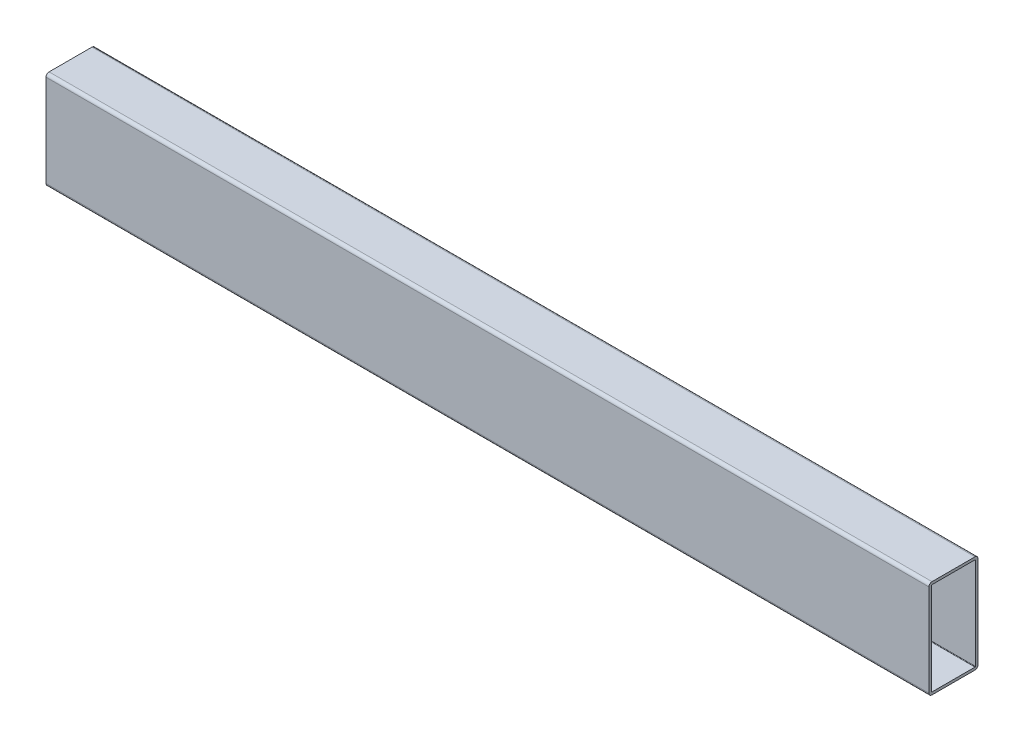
ISO-10303-21;
HEADER;
FILE_DESCRIPTION(('STEP AP214'),'2;1');
FILE_NAME('part.step','',(''),(''),'','','');
FILE_SCHEMA(('AUTOMOTIVE_DESIGN { 1 0 10303 214 1 1 1 1 }'));
ENDSEC;
DATA;
#1=APPLICATION_CONTEXT('core data for automotive mechanical design processes');
#2=APPLICATION_PROTOCOL_DEFINITION('international standard','automotive_design',2000,#1);
#3=PRODUCT_CONTEXT('',#1,'mechanical');
#4=PRODUCT('Part','Part','',(#3));
#5=PRODUCT_RELATED_PRODUCT_CATEGORY('part','',(#4));
#6=PRODUCT_DEFINITION_FORMATION('','',#4);
#7=PRODUCT_DEFINITION_CONTEXT('part definition',#1,'design');
#8=PRODUCT_DEFINITION('design','',#6,#7);
#9=PRODUCT_DEFINITION_SHAPE('','',#8);
#10=(LENGTH_UNIT() NAMED_UNIT(*) SI_UNIT(.MILLI.,.METRE.));
#11=(NAMED_UNIT(*) PLANE_ANGLE_UNIT() SI_UNIT($,.RADIAN.));
#12=(NAMED_UNIT(*) SI_UNIT($,.STERADIAN.) SOLID_ANGLE_UNIT());
#13=UNCERTAINTY_MEASURE_WITH_UNIT(LENGTH_MEASURE(1.E-05),#10,'distance_accuracy_value','');
#14=(GEOMETRIC_REPRESENTATION_CONTEXT(3) GLOBAL_UNCERTAINTY_ASSIGNED_CONTEXT((#13)) GLOBAL_UNIT_ASSIGNED_CONTEXT((#10,
#11,#12)) REPRESENTATION_CONTEXT('',''));
#15=CARTESIAN_POINT('',(0.,0.,0.));
#16=DIRECTION('',(0.,0.,1.));
#17=DIRECTION('',(1.,0.,0.));
#18=AXIS2_PLACEMENT_3D('',#15,#16,#17);
#19=CARTESIAN_POINT('',(457.2,3.65674086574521,-16.8519621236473));
#20=DIRECTION('',(-1.,0.,0.));
#21=DIRECTION('',(0.,0.,1.));
#22=AXIS2_PLACEMENT_3D('',#19,#20,#21);
#23=PLANE('',#22);
#24=CARTESIAN_POINT('',(457.2,3.65674086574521,-16.8519621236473));
#25=DIRECTION('',(1.,0.,0.));
#26=DIRECTION('',(0.,0.,1.));
#27=AXIS2_PLACEMENT_3D('',#24,#25,#26);
#28=CIRCLE('',#27,1.5875);
#29=CARTESIAN_POINT('',(457.2,3.6567408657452,-18.4394621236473));
#30=VERTEX_POINT('',#29);
#31=CARTESIAN_POINT('',(457.2,5.24424086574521,-16.8519621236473));
#32=VERTEX_POINT('',#31);
#33=EDGE_CURVE('E211',#30,#32,#28,.T.);
#34=ORIENTED_EDGE('',*,*,#33,.T.);
#35=DIRECTION('',(0.,0.,1.));
#36=VECTOR('',#35,1.);
#37=CARTESIAN_POINT('',(457.2,5.24424086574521,5.37303787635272));
#38=LINE('',#37,#36);
#39=CARTESIAN_POINT('',(457.2,5.24424086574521,5.37303787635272));
#40=VERTEX_POINT('',#39);
#41=EDGE_CURVE('E214',#32,#40,#38,.T.);
#42=ORIENTED_EDGE('',*,*,#41,.T.);
#43=CARTESIAN_POINT('',(457.2,3.65674086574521,5.37303787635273));
#44=DIRECTION('',(1.,0.,0.));
#45=DIRECTION('',(0.,0.,1.));
#46=AXIS2_PLACEMENT_3D('',#43,#44,#45);
#47=CIRCLE('',#46,1.5875);
#48=CARTESIAN_POINT('',(457.2,3.6567408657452,6.96053787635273));
#49=VERTEX_POINT('',#48);
#50=EDGE_CURVE('E217',#40,#49,#47,.T.);
#51=ORIENTED_EDGE('',*,*,#50,.T.);
#52=DIRECTION('',(0.,-1.,0.));
#53=VECTOR('',#52,1.);
#54=CARTESIAN_POINT('',(457.2,3.6567408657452,6.96053787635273));
#55=LINE('',#54,#53);
#56=CARTESIAN_POINT('',(457.2,-43.9682591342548,6.96053787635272));
#57=VERTEX_POINT('',#56);
#58=EDGE_CURVE('E219',#49,#57,#55,.T.);
#59=ORIENTED_EDGE('',*,*,#58,.T.);
#60=CARTESIAN_POINT('',(457.2,-43.9682591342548,5.37303787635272));
#61=DIRECTION('',(1.,0.,0.));
#62=DIRECTION('',(0.,0.,1.));
#63=AXIS2_PLACEMENT_3D('',#60,#61,#62);
#64=CIRCLE('',#63,1.5875);
#65=CARTESIAN_POINT('',(457.2,-45.5557591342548,5.37303787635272));
#66=VERTEX_POINT('',#65);
#67=EDGE_CURVE('E221',#57,#66,#64,.T.);
#68=ORIENTED_EDGE('',*,*,#67,.T.);
#69=DIRECTION('',(0.,0.,-1.));
#70=VECTOR('',#69,1.);
#71=CARTESIAN_POINT('',(457.2,-45.5557591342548,5.37303787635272));
#72=LINE('',#71,#70);
#73=CARTESIAN_POINT('',(457.2,-45.5557591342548,-16.8519621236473));
#74=VERTEX_POINT('',#73);
#75=EDGE_CURVE('E223',#66,#74,#72,.T.);
#76=ORIENTED_EDGE('',*,*,#75,.T.);
#77=CARTESIAN_POINT('',(457.2,-43.9682591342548,-16.8519621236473));
#78=DIRECTION('',(1.,0.,0.));
#79=DIRECTION('',(0.,0.,1.));
#80=AXIS2_PLACEMENT_3D('',#77,#78,#79);
#81=CIRCLE('',#80,1.5875);
#82=CARTESIAN_POINT('',(457.2,-43.9682591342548,-18.4394621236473));
#83=VERTEX_POINT('',#82);
#84=EDGE_CURVE('E225',#74,#83,#81,.T.);
#85=ORIENTED_EDGE('',*,*,#84,.T.);
#86=DIRECTION('',(0.,1.,0.));
#87=VECTOR('',#86,1.);
#88=CARTESIAN_POINT('',(457.2,3.6567408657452,-18.4394621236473));
#89=LINE('',#88,#87);
#90=EDGE_CURVE('E227',#83,#30,#89,.T.);
#91=ORIENTED_EDGE('',*,*,#90,.T.);
#92=EDGE_LOOP('',(#34,#42,#51,#59,#68,#76,#85,#91));
#93=FACE_BOUND('',#92,.T.);
#94=CARTESIAN_POINT('',(457.2,3.65674086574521,5.37303787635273));
#95=DIRECTION('',(1.,0.,0.));
#96=DIRECTION('',(0.,0.,1.));
#97=AXIS2_PLACEMENT_3D('',#94,#95,#96);
#98=CIRCLE('',#97,0.2413);
#99=CARTESIAN_POINT('',(457.2,3.89804086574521,5.37303787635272));
#100=VERTEX_POINT('',#99);
#101=CARTESIAN_POINT('',(457.2,3.6567408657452,5.61433787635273));
#102=VERTEX_POINT('',#101);
#103=EDGE_CURVE('E146',#100,#102,#98,.T.);
#104=ORIENTED_EDGE('',*,*,#103,.F.);
#105=DIRECTION('',(0.,0.,1.));
#106=VECTOR('',#105,1.);
#107=CARTESIAN_POINT('',(457.2,3.89804086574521,5.37303787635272));
#108=LINE('',#107,#106);
#109=CARTESIAN_POINT('',(457.2,3.89804086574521,-16.8519621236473));
#110=VERTEX_POINT('',#109);
#111=EDGE_CURVE('E179',#110,#100,#108,.T.);
#112=ORIENTED_EDGE('',*,*,#111,.F.);
#113=CARTESIAN_POINT('',(457.2,3.65674086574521,-16.8519621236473));
#114=DIRECTION('',(1.,0.,0.));
#115=DIRECTION('',(0.,0.,1.));
#116=AXIS2_PLACEMENT_3D('',#113,#114,#115);
#117=CIRCLE('',#116,0.2413);
#118=CARTESIAN_POINT('',(457.2,3.65674086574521,-17.0932621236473));
#119=VERTEX_POINT('',#118);
#120=EDGE_CURVE('E177',#119,#110,#117,.T.);
#121=ORIENTED_EDGE('',*,*,#120,.F.);
#122=DIRECTION('',(0.,1.,0.));
#123=VECTOR('',#122,1.);
#124=CARTESIAN_POINT('',(457.2,3.65674086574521,-17.0932621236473));
#125=LINE('',#124,#123);
#126=CARTESIAN_POINT('',(457.2,-43.9682591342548,-17.0932621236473));
#127=VERTEX_POINT('',#126);
#128=EDGE_CURVE('E175',#127,#119,#125,.T.);
#129=ORIENTED_EDGE('',*,*,#128,.F.);
#130=CARTESIAN_POINT('',(457.2,-43.9682591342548,-16.8519621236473));
#131=DIRECTION('',(1.,0.,0.));
#132=DIRECTION('',(0.,0.,1.));
#133=AXIS2_PLACEMENT_3D('',#130,#131,#132);
#134=CIRCLE('',#133,0.2413);
#135=CARTESIAN_POINT('',(457.2,-44.2095591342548,-16.8519621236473));
#136=VERTEX_POINT('',#135);
#137=EDGE_CURVE('E173',#136,#127,#134,.T.);
#138=ORIENTED_EDGE('',*,*,#137,.F.);
#139=DIRECTION('',(0.,0.,-1.));
#140=VECTOR('',#139,1.);
#141=CARTESIAN_POINT('',(457.2,-44.2095591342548,5.37303787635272));
#142=LINE('',#141,#140);
#143=CARTESIAN_POINT('',(457.2,-44.2095591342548,5.37303787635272));
#144=VERTEX_POINT('',#143);
#145=EDGE_CURVE('E169',#144,#136,#142,.T.);
#146=ORIENTED_EDGE('',*,*,#145,.F.);
#147=CARTESIAN_POINT('',(457.2,-43.9682591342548,5.37303787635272));
#148=DIRECTION('',(1.,0.,0.));
#149=DIRECTION('',(0.,0.,1.));
#150=AXIS2_PLACEMENT_3D('',#147,#148,#149);
#151=CIRCLE('',#150,0.2413);
#152=CARTESIAN_POINT('',(457.2,-43.9682591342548,5.61433787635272));
#153=VERTEX_POINT('',#152);
#154=EDGE_CURVE('E167',#153,#144,#151,.T.);
#155=ORIENTED_EDGE('',*,*,#154,.F.);
#156=DIRECTION('',(0.,-1.,0.));
#157=VECTOR('',#156,1.);
#158=CARTESIAN_POINT('',(457.2,3.6567408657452,5.61433787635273));
#159=LINE('',#158,#157);
#160=EDGE_CURVE('E154',#102,#153,#159,.T.);
#161=ORIENTED_EDGE('',*,*,#160,.F.);
#162=EDGE_LOOP('',(#104,#112,#121,#129,#138,#146,#155,#161));
#163=FACE_BOUND('',#162,.T.);
#164=ADVANCED_FACE('F33',(#93,#163),#23,.F.);
#165=CARTESIAN_POINT('',(0.,3.65674086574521,-16.8519621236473));
#166=DIRECTION('',(-1.,0.,0.));
#167=DIRECTION('',(0.,0.,1.));
#168=AXIS2_PLACEMENT_3D('',#165,#166,#167);
#169=PLANE('',#168);
#170=CARTESIAN_POINT('',(0.,3.65674086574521,-16.8519621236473));
#171=DIRECTION('',(1.,0.,0.));
#172=DIRECTION('',(0.,0.,1.));
#173=AXIS2_PLACEMENT_3D('',#170,#171,#172);
#174=CIRCLE('',#173,1.5875);
#175=CARTESIAN_POINT('',(0.,3.6567408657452,-18.4394621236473));
#176=VERTEX_POINT('',#175);
#177=CARTESIAN_POINT('',(0.,5.24424086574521,-16.8519621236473));
#178=VERTEX_POINT('',#177);
#179=EDGE_CURVE('E162',#176,#178,#174,.T.);
#180=ORIENTED_EDGE('',*,*,#179,.F.);
#181=DIRECTION('',(0.,1.,0.));
#182=VECTOR('',#181,1.);
#183=CARTESIAN_POINT('',(0.,3.6567408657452,-18.4394621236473));
#184=LINE('',#183,#182);
#185=CARTESIAN_POINT('',(0.,-43.9682591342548,-18.4394621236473));
#186=VERTEX_POINT('',#185);
#187=EDGE_CURVE('E215',#186,#176,#184,.T.);
#188=ORIENTED_EDGE('',*,*,#187,.F.);
#189=CARTESIAN_POINT('',(0.,-43.9682591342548,-16.8519621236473));
#190=DIRECTION('',(1.,0.,0.));
#191=DIRECTION('',(0.,0.,1.));
#192=AXIS2_PLACEMENT_3D('',#189,#190,#191);
#193=CIRCLE('',#192,1.5875);
#194=CARTESIAN_POINT('',(0.,-45.5557591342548,-16.8519621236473));
#195=VERTEX_POINT('',#194);
#196=EDGE_CURVE('E242',#195,#186,#193,.T.);
#197=ORIENTED_EDGE('',*,*,#196,.F.);
#198=DIRECTION('',(0.,0.,-1.));
#199=VECTOR('',#198,1.);
#200=CARTESIAN_POINT('',(0.,-45.5557591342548,5.37303787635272));
#201=LINE('',#200,#199);
#202=CARTESIAN_POINT('',(0.,-45.5557591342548,5.37303787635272));
#203=VERTEX_POINT('',#202);
#204=EDGE_CURVE('E240',#203,#195,#201,.T.);
#205=ORIENTED_EDGE('',*,*,#204,.F.);
#206=CARTESIAN_POINT('',(0.,-43.9682591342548,5.37303787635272));
#207=DIRECTION('',(1.,0.,0.));
#208=DIRECTION('',(0.,0.,1.));
#209=AXIS2_PLACEMENT_3D('',#206,#207,#208);
#210=CIRCLE('',#209,1.5875);
#211=CARTESIAN_POINT('',(0.,-43.9682591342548,6.96053787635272));
#212=VERTEX_POINT('',#211);
#213=EDGE_CURVE('E238',#212,#203,#210,.T.);
#214=ORIENTED_EDGE('',*,*,#213,.F.);
#215=DIRECTION('',(0.,-1.,0.));
#216=VECTOR('',#215,1.);
#217=CARTESIAN_POINT('',(0.,3.6567408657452,6.96053787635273));
#218=LINE('',#217,#216);
#219=CARTESIAN_POINT('',(0.,3.6567408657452,6.96053787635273));
#220=VERTEX_POINT('',#219);
#221=EDGE_CURVE('E236',#220,#212,#218,.T.);
#222=ORIENTED_EDGE('',*,*,#221,.F.);
#223=CARTESIAN_POINT('',(0.,3.65674086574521,5.37303787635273));
#224=DIRECTION('',(1.,0.,0.));
#225=DIRECTION('',(0.,0.,1.));
#226=AXIS2_PLACEMENT_3D('',#223,#224,#225);
#227=CIRCLE('',#226,1.5875);
#228=CARTESIAN_POINT('',(0.,5.24424086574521,5.37303787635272));
#229=VERTEX_POINT('',#228);
#230=EDGE_CURVE('E234',#229,#220,#227,.T.);
#231=ORIENTED_EDGE('',*,*,#230,.F.);
#232=DIRECTION('',(0.,0.,1.));
#233=VECTOR('',#232,1.);
#234=CARTESIAN_POINT('',(0.,5.24424086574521,5.37303787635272));
#235=LINE('',#234,#233);
#236=EDGE_CURVE('E232',#178,#229,#235,.T.);
#237=ORIENTED_EDGE('',*,*,#236,.F.);
#238=EDGE_LOOP('',(#180,#188,#197,#205,#214,#222,#231,#237));
#239=FACE_BOUND('',#238,.T.);
#240=DIRECTION('',(0.,0.,1.));
#241=VECTOR('',#240,1.);
#242=CARTESIAN_POINT('',(0.,3.89804086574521,5.37303787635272));
#243=LINE('',#242,#241);
#244=CARTESIAN_POINT('',(0.,3.89804086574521,-16.8519621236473));
#245=VERTEX_POINT('',#244);
#246=CARTESIAN_POINT('',(0.,3.89804086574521,5.37303787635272));
#247=VERTEX_POINT('',#246);
#248=EDGE_CURVE('E155',#245,#247,#243,.T.);
#249=ORIENTED_EDGE('',*,*,#248,.T.);
#250=CARTESIAN_POINT('',(0.,3.65674086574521,5.37303787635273));
#251=DIRECTION('',(1.,0.,0.));
#252=DIRECTION('',(0.,0.,1.));
#253=AXIS2_PLACEMENT_3D('',#250,#251,#252);
#254=CIRCLE('',#253,0.2413);
#255=CARTESIAN_POINT('',(0.,3.6567408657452,5.61433787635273));
#256=VERTEX_POINT('',#255);
#257=EDGE_CURVE('E56',#247,#256,#254,.T.);
#258=ORIENTED_EDGE('',*,*,#257,.T.);
#259=DIRECTION('',(0.,-1.,0.));
#260=VECTOR('',#259,1.);
#261=CARTESIAN_POINT('',(0.,3.6567408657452,5.61433787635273));
#262=LINE('',#261,#260);
#263=CARTESIAN_POINT('',(0.,-43.9682591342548,5.61433787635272));
#264=VERTEX_POINT('',#263);
#265=EDGE_CURVE('E161',#256,#264,#262,.T.);
#266=ORIENTED_EDGE('',*,*,#265,.T.);
#267=CARTESIAN_POINT('',(0.,-43.9682591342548,5.37303787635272));
#268=DIRECTION('',(1.,0.,0.));
#269=DIRECTION('',(0.,0.,1.));
#270=AXIS2_PLACEMENT_3D('',#267,#268,#269);
#271=CIRCLE('',#270,0.2413);
#272=CARTESIAN_POINT('',(0.,-44.2095591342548,5.37303787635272));
#273=VERTEX_POINT('',#272);
#274=EDGE_CURVE('E183',#264,#273,#271,.T.);
#275=ORIENTED_EDGE('',*,*,#274,.T.);
#276=DIRECTION('',(0.,0.,-1.));
#277=VECTOR('',#276,1.);
#278=CARTESIAN_POINT('',(0.,-44.2095591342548,5.37303787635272));
#279=LINE('',#278,#277);
#280=CARTESIAN_POINT('',(0.,-44.2095591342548,-16.8519621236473));
#281=VERTEX_POINT('',#280);
#282=EDGE_CURVE('E186',#273,#281,#279,.T.);
#283=ORIENTED_EDGE('',*,*,#282,.T.);
#284=CARTESIAN_POINT('',(0.,-43.9682591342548,-16.8519621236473));
#285=DIRECTION('',(1.,0.,0.));
#286=DIRECTION('',(0.,0.,1.));
#287=AXIS2_PLACEMENT_3D('',#284,#285,#286);
#288=CIRCLE('',#287,0.2413);
#289=CARTESIAN_POINT('',(0.,-43.9682591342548,-17.0932621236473));
#290=VERTEX_POINT('',#289);
#291=EDGE_CURVE('E189',#281,#290,#288,.T.);
#292=ORIENTED_EDGE('',*,*,#291,.T.);
#293=DIRECTION('',(0.,1.,0.));
#294=VECTOR('',#293,1.);
#295=CARTESIAN_POINT('',(0.,3.65674086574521,-17.0932621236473));
#296=LINE('',#295,#294);
#297=CARTESIAN_POINT('',(0.,3.65674086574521,-17.0932621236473));
#298=VERTEX_POINT('',#297);
#299=EDGE_CURVE('E192',#290,#298,#296,.T.);
#300=ORIENTED_EDGE('',*,*,#299,.T.);
#301=CARTESIAN_POINT('',(0.,3.65674086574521,-16.8519621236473));
#302=DIRECTION('',(1.,0.,0.));
#303=DIRECTION('',(0.,0.,1.));
#304=AXIS2_PLACEMENT_3D('',#301,#302,#303);
#305=CIRCLE('',#304,0.2413);
#306=EDGE_CURVE('E195',#298,#245,#305,.T.);
#307=ORIENTED_EDGE('',*,*,#306,.T.);
#308=EDGE_LOOP('',(#249,#258,#266,#275,#283,#292,#300,#307));
#309=FACE_BOUND('',#308,.T.);
#310=ADVANCED_FACE('F272',(#239,#309),#169,.T.);
#311=CARTESIAN_POINT('',(457.2,3.65674086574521,-16.8519621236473));
#312=DIRECTION('',(-1.,0.,0.));
#313=DIRECTION('',(0.,0.,1.));
#314=AXIS2_PLACEMENT_3D('',#311,#312,#313);
#315=CYLINDRICAL_SURFACE('',#314,1.5875);
#316=ORIENTED_EDGE('',*,*,#179,.T.);
#317=DIRECTION('',(-1.,0.,0.));
#318=VECTOR('',#317,1.);
#319=CARTESIAN_POINT('',(457.2,5.24424086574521,-16.8519621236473));
#320=LINE('',#319,#318);
#321=EDGE_CURVE('E11',#32,#178,#320,.T.);
#322=ORIENTED_EDGE('',*,*,#321,.F.);
#323=ORIENTED_EDGE('',*,*,#33,.F.);
#324=DIRECTION('',(-1.,0.,0.));
#325=VECTOR('',#324,1.);
#326=CARTESIAN_POINT('',(457.2,3.6567408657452,-18.4394621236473));
#327=LINE('',#326,#325);
#328=EDGE_CURVE('E229',#30,#176,#327,.T.);
#329=ORIENTED_EDGE('',*,*,#328,.T.);
#330=EDGE_LOOP('',(#316,#322,#323,#329));
#331=FACE_BOUND('',#330,.T.);
#332=ADVANCED_FACE('F35',(#331),#315,.T.);
#333=CARTESIAN_POINT('',(457.2,5.24424086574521,5.37303787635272));
#334=DIRECTION('',(0.,-1.,0.));
#335=DIRECTION('',(0.,0.,-1.));
#336=AXIS2_PLACEMENT_3D('',#333,#334,#335);
#337=PLANE('',#336);
#338=ORIENTED_EDGE('',*,*,#236,.T.);
#339=DIRECTION('',(-1.,0.,0.));
#340=VECTOR('',#339,1.);
#341=CARTESIAN_POINT('',(457.2,5.24424086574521,5.37303787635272));
#342=LINE('',#341,#340);
#343=EDGE_CURVE('E41',#40,#229,#342,.T.);
#344=ORIENTED_EDGE('',*,*,#343,.F.);
#345=ORIENTED_EDGE('',*,*,#41,.F.);
#346=ORIENTED_EDGE('',*,*,#321,.T.);
#347=EDGE_LOOP('',(#338,#344,#345,#346));
#348=FACE_BOUND('',#347,.T.);
#349=ADVANCED_FACE('F289',(#348),#337,.F.);
#350=CARTESIAN_POINT('',(457.2,3.65674086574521,5.37303787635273));
#351=DIRECTION('',(-1.,0.,0.));
#352=DIRECTION('',(0.,0.,1.));
#353=AXIS2_PLACEMENT_3D('',#350,#351,#352);
#354=CYLINDRICAL_SURFACE('',#353,1.5875);
#355=ORIENTED_EDGE('',*,*,#230,.T.);
#356=DIRECTION('',(-1.,0.,0.));
#357=VECTOR('',#356,1.);
#358=CARTESIAN_POINT('',(457.2,3.6567408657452,6.96053787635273));
#359=LINE('',#358,#357);
#360=EDGE_CURVE('E259',#49,#220,#359,.T.);
#361=ORIENTED_EDGE('',*,*,#360,.F.);
#362=ORIENTED_EDGE('',*,*,#50,.F.);
#363=ORIENTED_EDGE('',*,*,#343,.T.);
#364=EDGE_LOOP('',(#355,#361,#362,#363));
#365=FACE_BOUND('',#364,.T.);
#366=ADVANCED_FACE('F266',(#365),#354,.T.);
#367=CARTESIAN_POINT('',(457.2,3.6567408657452,6.96053787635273));
#368=DIRECTION('',(0.,0.,-1.));
#369=DIRECTION('',(0.,1.,0.));
#370=AXIS2_PLACEMENT_3D('',#367,#368,#369);
#371=PLANE('',#370);
#372=ORIENTED_EDGE('',*,*,#221,.T.);
#373=DIRECTION('',(-1.,0.,0.));
#374=VECTOR('',#373,1.);
#375=CARTESIAN_POINT('',(457.2,-43.9682591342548,6.96053787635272));
#376=LINE('',#375,#374);
#377=EDGE_CURVE('E256',#57,#212,#376,.T.);
#378=ORIENTED_EDGE('',*,*,#377,.F.);
#379=ORIENTED_EDGE('',*,*,#58,.F.);
#380=ORIENTED_EDGE('',*,*,#360,.T.);
#381=EDGE_LOOP('',(#372,#378,#379,#380));
#382=FACE_BOUND('',#381,.T.);
#383=ADVANCED_FACE('F278',(#382),#371,.F.);
#384=CARTESIAN_POINT('',(457.2,-43.9682591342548,5.37303787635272));
#385=DIRECTION('',(-1.,0.,0.));
#386=DIRECTION('',(0.,0.,1.));
#387=AXIS2_PLACEMENT_3D('',#384,#385,#386);
#388=CYLINDRICAL_SURFACE('',#387,1.5875);
#389=ORIENTED_EDGE('',*,*,#213,.T.);
#390=DIRECTION('',(-1.,0.,0.));
#391=VECTOR('',#390,1.);
#392=CARTESIAN_POINT('',(457.2,-45.5557591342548,5.37303787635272));
#393=LINE('',#392,#391);
#394=EDGE_CURVE('E253',#66,#203,#393,.T.);
#395=ORIENTED_EDGE('',*,*,#394,.F.);
#396=ORIENTED_EDGE('',*,*,#67,.F.);
#397=ORIENTED_EDGE('',*,*,#377,.T.);
#398=EDGE_LOOP('',(#389,#395,#396,#397));
#399=FACE_BOUND('',#398,.T.);
#400=ADVANCED_FACE('F282',(#399),#388,.T.);
#401=CARTESIAN_POINT('',(457.2,-45.5557591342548,5.37303787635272));
#402=DIRECTION('',(0.,1.,0.));
#403=DIRECTION('',(0.,0.,1.));
#404=AXIS2_PLACEMENT_3D('',#401,#402,#403);
#405=PLANE('',#404);
#406=ORIENTED_EDGE('',*,*,#204,.T.);
#407=DIRECTION('',(-1.,0.,0.));
#408=VECTOR('',#407,1.);
#409=CARTESIAN_POINT('',(457.2,-45.5557591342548,-16.8519621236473));
#410=LINE('',#409,#408);
#411=EDGE_CURVE('E250',#74,#195,#410,.T.);
#412=ORIENTED_EDGE('',*,*,#411,.F.);
#413=ORIENTED_EDGE('',*,*,#75,.F.);
#414=ORIENTED_EDGE('',*,*,#394,.T.);
#415=EDGE_LOOP('',(#406,#412,#413,#414));
#416=FACE_BOUND('',#415,.T.);
#417=ADVANCED_FACE('F302',(#416),#405,.F.);
#418=CARTESIAN_POINT('',(457.2,-43.9682591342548,-16.8519621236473));
#419=DIRECTION('',(-1.,0.,0.));
#420=DIRECTION('',(0.,0.,1.));
#421=AXIS2_PLACEMENT_3D('',#418,#419,#420);
#422=CYLINDRICAL_SURFACE('',#421,1.5875);
#423=ORIENTED_EDGE('',*,*,#196,.T.);
#424=DIRECTION('',(-1.,0.,0.));
#425=VECTOR('',#424,1.);
#426=CARTESIAN_POINT('',(457.2,-43.9682591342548,-18.4394621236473));
#427=LINE('',#426,#425);
#428=EDGE_CURVE('E247',#83,#186,#427,.T.);
#429=ORIENTED_EDGE('',*,*,#428,.F.);
#430=ORIENTED_EDGE('',*,*,#84,.F.);
#431=ORIENTED_EDGE('',*,*,#411,.T.);
#432=EDGE_LOOP('',(#423,#429,#430,#431));
#433=FACE_BOUND('',#432,.T.);
#434=ADVANCED_FACE('F300',(#433),#422,.T.);
#435=CARTESIAN_POINT('',(457.2,3.6567408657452,-18.4394621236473));
#436=DIRECTION('',(0.,0.,1.));
#437=DIRECTION('',(0.,-1.,0.));
#438=AXIS2_PLACEMENT_3D('',#435,#436,#437);
#439=PLANE('',#438);
#440=ORIENTED_EDGE('',*,*,#187,.T.);
#441=ORIENTED_EDGE('',*,*,#328,.F.);
#442=ORIENTED_EDGE('',*,*,#90,.F.);
#443=ORIENTED_EDGE('',*,*,#428,.T.);
#444=EDGE_LOOP('',(#440,#441,#442,#443));
#445=FACE_BOUND('',#444,.T.);
#446=ADVANCED_FACE('F295',(#445),#439,.F.);
#447=CARTESIAN_POINT('',(457.2,3.65674086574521,5.37303787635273));
#448=DIRECTION('',(-1.,0.,0.));
#449=DIRECTION('',(0.,0.,1.));
#450=AXIS2_PLACEMENT_3D('',#447,#448,#449);
#451=CYLINDRICAL_SURFACE('',#450,0.2413);
#452=ORIENTED_EDGE('',*,*,#257,.F.);
#453=DIRECTION('',(-1.,0.,0.));
#454=VECTOR('',#453,1.);
#455=CARTESIAN_POINT('',(457.2,3.89804086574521,5.37303787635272));
#456=LINE('',#455,#454);
#457=EDGE_CURVE('E150',#100,#247,#456,.T.);
#458=ORIENTED_EDGE('',*,*,#457,.F.);
#459=ORIENTED_EDGE('',*,*,#103,.T.);
#460=DIRECTION('',(-1.,0.,0.));
#461=VECTOR('',#460,1.);
#462=CARTESIAN_POINT('',(457.2,3.6567408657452,5.61433787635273));
#463=LINE('',#462,#461);
#464=EDGE_CURVE('E149',#102,#256,#463,.T.);
#465=ORIENTED_EDGE('',*,*,#464,.T.);
#466=EDGE_LOOP('',(#452,#458,#459,#465));
#467=FACE_BOUND('',#466,.T.);
#468=ADVANCED_FACE('F148',(#467),#451,.F.);
#469=CARTESIAN_POINT('',(457.2,3.6567408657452,5.61433787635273));
#470=DIRECTION('',(0.,0.,-1.));
#471=DIRECTION('',(0.,1.,0.));
#472=AXIS2_PLACEMENT_3D('',#469,#470,#471);
#473=PLANE('',#472);
#474=ORIENTED_EDGE('',*,*,#265,.F.);
#475=ORIENTED_EDGE('',*,*,#464,.F.);
#476=ORIENTED_EDGE('',*,*,#160,.T.);
#477=DIRECTION('',(-1.,0.,0.));
#478=VECTOR('',#477,1.);
#479=CARTESIAN_POINT('',(457.2,-43.9682591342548,5.61433787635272));
#480=LINE('',#479,#478);
#481=EDGE_CURVE('E163',#153,#264,#480,.T.);
#482=ORIENTED_EDGE('',*,*,#481,.T.);
#483=EDGE_LOOP('',(#474,#475,#476,#482));
#484=FACE_BOUND('',#483,.T.);
#485=ADVANCED_FACE('F158',(#484),#473,.T.);
#486=CARTESIAN_POINT('',(457.2,-43.9682591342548,5.37303787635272));
#487=DIRECTION('',(-1.,0.,0.));
#488=DIRECTION('',(0.,0.,1.));
#489=AXIS2_PLACEMENT_3D('',#486,#487,#488);
#490=CYLINDRICAL_SURFACE('',#489,0.2413);
#491=ORIENTED_EDGE('',*,*,#274,.F.);
#492=ORIENTED_EDGE('',*,*,#481,.F.);
#493=ORIENTED_EDGE('',*,*,#154,.T.);
#494=DIRECTION('',(-1.,0.,0.));
#495=VECTOR('',#494,1.);
#496=CARTESIAN_POINT('',(457.2,-44.2095591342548,5.37303787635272));
#497=LINE('',#496,#495);
#498=EDGE_CURVE('E208',#144,#273,#497,.T.);
#499=ORIENTED_EDGE('',*,*,#498,.T.);
#500=EDGE_LOOP('',(#491,#492,#493,#499));
#501=FACE_BOUND('',#500,.T.);
#502=ADVANCED_FACE('F327',(#501),#490,.F.);
#503=CARTESIAN_POINT('',(457.2,-44.2095591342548,5.37303787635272));
#504=DIRECTION('',(0.,1.,0.));
#505=DIRECTION('',(0.,0.,1.));
#506=AXIS2_PLACEMENT_3D('',#503,#504,#505);
#507=PLANE('',#506);
#508=ORIENTED_EDGE('',*,*,#282,.F.);
#509=ORIENTED_EDGE('',*,*,#498,.F.);
#510=ORIENTED_EDGE('',*,*,#145,.T.);
#511=DIRECTION('',(-1.,0.,0.));
#512=VECTOR('',#511,1.);
#513=CARTESIAN_POINT('',(457.2,-44.2095591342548,-16.8519621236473));
#514=LINE('',#513,#512);
#515=EDGE_CURVE('E206',#136,#281,#514,.T.);
#516=ORIENTED_EDGE('',*,*,#515,.T.);
#517=EDGE_LOOP('',(#508,#509,#510,#516));
#518=FACE_BOUND('',#517,.T.);
#519=ADVANCED_FACE('F331',(#518),#507,.T.);
#520=CARTESIAN_POINT('',(457.2,-43.9682591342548,-16.8519621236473));
#521=DIRECTION('',(-1.,0.,0.));
#522=DIRECTION('',(0.,0.,1.));
#523=AXIS2_PLACEMENT_3D('',#520,#521,#522);
#524=CYLINDRICAL_SURFACE('',#523,0.2413);
#525=ORIENTED_EDGE('',*,*,#291,.F.);
#526=ORIENTED_EDGE('',*,*,#515,.F.);
#527=ORIENTED_EDGE('',*,*,#137,.T.);
#528=DIRECTION('',(-1.,0.,0.));
#529=VECTOR('',#528,1.);
#530=CARTESIAN_POINT('',(457.2,-43.9682591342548,-17.0932621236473));
#531=LINE('',#530,#529);
#532=EDGE_CURVE('E204',#127,#290,#531,.T.);
#533=ORIENTED_EDGE('',*,*,#532,.T.);
#534=EDGE_LOOP('',(#525,#526,#527,#533));
#535=FACE_BOUND('',#534,.T.);
#536=ADVANCED_FACE('F337',(#535),#524,.F.);
#537=CARTESIAN_POINT('',(457.2,3.65674086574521,-17.0932621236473));
#538=DIRECTION('',(0.,0.,1.));
#539=DIRECTION('',(0.,-1.,0.));
#540=AXIS2_PLACEMENT_3D('',#537,#538,#539);
#541=PLANE('',#540);
#542=ORIENTED_EDGE('',*,*,#299,.F.);
#543=ORIENTED_EDGE('',*,*,#532,.F.);
#544=ORIENTED_EDGE('',*,*,#128,.T.);
#545=DIRECTION('',(-1.,0.,0.));
#546=VECTOR('',#545,1.);
#547=CARTESIAN_POINT('',(457.2,3.65674086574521,-17.0932621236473));
#548=LINE('',#547,#546);
#549=EDGE_CURVE('E202',#119,#298,#548,.T.);
#550=ORIENTED_EDGE('',*,*,#549,.T.);
#551=EDGE_LOOP('',(#542,#543,#544,#550));
#552=FACE_BOUND('',#551,.T.);
#553=ADVANCED_FACE('F341',(#552),#541,.T.);
#554=CARTESIAN_POINT('',(457.2,3.65674086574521,-16.8519621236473));
#555=DIRECTION('',(-1.,0.,0.));
#556=DIRECTION('',(0.,0.,1.));
#557=AXIS2_PLACEMENT_3D('',#554,#555,#556);
#558=CYLINDRICAL_SURFACE('',#557,0.2413);
#559=ORIENTED_EDGE('',*,*,#306,.F.);
#560=ORIENTED_EDGE('',*,*,#549,.F.);
#561=ORIENTED_EDGE('',*,*,#120,.T.);
#562=DIRECTION('',(-1.,0.,0.));
#563=VECTOR('',#562,1.);
#564=CARTESIAN_POINT('',(457.2,3.89804086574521,-16.8519621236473));
#565=LINE('',#564,#563);
#566=EDGE_CURVE('E48',#110,#245,#565,.T.);
#567=ORIENTED_EDGE('',*,*,#566,.T.);
#568=EDGE_LOOP('',(#559,#560,#561,#567));
#569=FACE_BOUND('',#568,.T.);
#570=ADVANCED_FACE('F345',(#569),#558,.F.);
#571=CARTESIAN_POINT('',(457.2,3.89804086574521,5.37303787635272));
#572=DIRECTION('',(0.,-1.,0.));
#573=DIRECTION('',(0.,0.,-1.));
#574=AXIS2_PLACEMENT_3D('',#571,#572,#573);
#575=PLANE('',#574);
#576=ORIENTED_EDGE('',*,*,#248,.F.);
#577=ORIENTED_EDGE('',*,*,#566,.F.);
#578=ORIENTED_EDGE('',*,*,#111,.T.);
#579=ORIENTED_EDGE('',*,*,#457,.T.);
#580=EDGE_LOOP('',(#576,#577,#578,#579));
#581=FACE_BOUND('',#580,.T.);
#582=ADVANCED_FACE('F349',(#581),#575,.T.);
#583=CLOSED_SHELL('',(#164,#310,#332,#349,#366,#383,#400,#417,#434,#446,#468,#485,#502,#519,
#536,#553,#570,#582));
#584=MANIFOLD_SOLID_BREP('B2',#583);
#585=ADVANCED_BREP_SHAPE_REPRESENTATION('',(#18,#584),#14);
#586=SHAPE_DEFINITION_REPRESENTATION(#9,#585);
ENDSEC;
END-ISO-10303-21;
